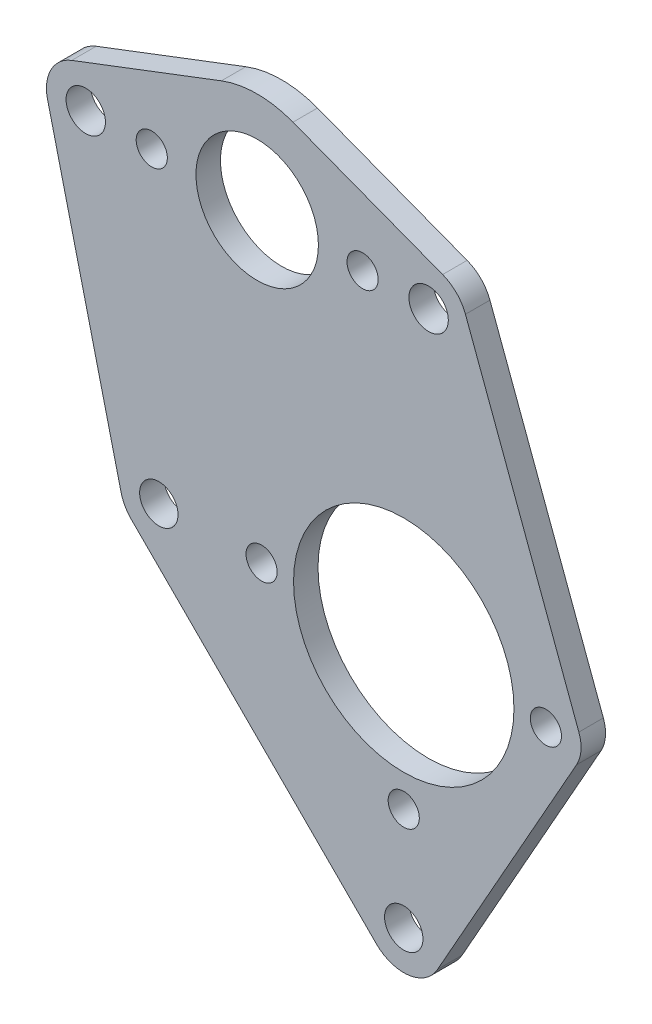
ISO-10303-21;
HEADER;
FILE_DESCRIPTION(('STEP AP214'),'2;1');
FILE_NAME('part.step','',(''),(''),'','','');
FILE_SCHEMA(('AUTOMOTIVE_DESIGN { 1 0 10303 214 1 1 1 1 }'));
ENDSEC;
DATA;
#1=APPLICATION_CONTEXT('core data for automotive mechanical design processes');
#2=APPLICATION_PROTOCOL_DEFINITION('international standard','automotive_design',2000,#1);
#3=PRODUCT_CONTEXT('',#1,'mechanical');
#4=PRODUCT('Part','Part','',(#3));
#5=PRODUCT_RELATED_PRODUCT_CATEGORY('part','',(#4));
#6=PRODUCT_DEFINITION_FORMATION('','',#4);
#7=PRODUCT_DEFINITION_CONTEXT('part definition',#1,'design');
#8=PRODUCT_DEFINITION('design','',#6,#7);
#9=PRODUCT_DEFINITION_SHAPE('','',#8);
#10=(LENGTH_UNIT() NAMED_UNIT(*) SI_UNIT(.MILLI.,.METRE.));
#11=(NAMED_UNIT(*) PLANE_ANGLE_UNIT() SI_UNIT($,.RADIAN.));
#12=(NAMED_UNIT(*) SI_UNIT($,.STERADIAN.) SOLID_ANGLE_UNIT());
#13=UNCERTAINTY_MEASURE_WITH_UNIT(LENGTH_MEASURE(1.E-05),#10,'distance_accuracy_value','');
#14=(GEOMETRIC_REPRESENTATION_CONTEXT(3) GLOBAL_UNCERTAINTY_ASSIGNED_CONTEXT((#13)) GLOBAL_UNIT_ASSIGNED_CONTEXT((#10,
#11,#12)) REPRESENTATION_CONTEXT('',''));
#15=CARTESIAN_POINT('',(0.,0.,0.));
#16=DIRECTION('',(0.,0.,1.));
#17=DIRECTION('',(1.,0.,0.));
#18=AXIS2_PLACEMENT_3D('',#15,#16,#17);
#19=CARTESIAN_POINT('',(-31.75,0.,3.175));
#20=DIRECTION('',(0.,0.,1.));
#21=DIRECTION('',(1.,0.,0.));
#22=AXIS2_PLACEMENT_3D('',#19,#20,#21);
#23=PLANE('',#22);
#24=CARTESIAN_POINT('',(-5.334,39.37,3.175));
#25=DIRECTION('',(0.,0.,1.));
#26=DIRECTION('',(1.,0.,0.));
#27=AXIS2_PLACEMENT_3D('',#24,#25,#26);
#28=CIRCLE('',#27,2.01929999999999);
#29=CARTESIAN_POINT('',(-3.31470000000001,39.37,3.175));
#30=VERTEX_POINT('',#29);
#31=EDGE_CURVE('E326',#30,#30,#28,.T.);
#32=ORIENTED_EDGE('',*,*,#31,.F.);
#33=EDGE_LOOP('',(#32));
#34=FACE_BOUND('',#33,.T.);
#35=CARTESIAN_POINT('',(-41.2242,39.37,3.175));
#36=DIRECTION('',(0.,0.,1.));
#37=DIRECTION('',(1.,0.,0.));
#38=AXIS2_PLACEMENT_3D('',#35,#36,#37);
#39=CIRCLE('',#38,2.5527);
#40=CARTESIAN_POINT('',(-38.6715,39.37,3.175));
#41=VERTEX_POINT('',#40);
#42=EDGE_CURVE('E340',#41,#41,#39,.T.);
#43=ORIENTED_EDGE('',*,*,#42,.F.);
#44=EDGE_LOOP('',(#43));
#45=FACE_BOUND('',#44,.T.);
#46=CARTESIAN_POINT('',(0.,-31.75,3.175));
#47=DIRECTION('',(0.,0.,1.));
#48=DIRECTION('',(1.,0.,0.));
#49=AXIS2_PLACEMENT_3D('',#46,#47,#48);
#50=CIRCLE('',#49,2.4892);
#51=CARTESIAN_POINT('',(2.4892,-31.75,3.175));
#52=VERTEX_POINT('',#51);
#53=EDGE_CURVE('E352',#52,#52,#50,.T.);
#54=ORIENTED_EDGE('',*,*,#53,.F.);
#55=EDGE_LOOP('',(#54));
#56=FACE_BOUND('',#55,.T.);
#57=CARTESIAN_POINT('',(0.,-18.4277,3.175));
#58=DIRECTION('',(0.,0.,1.));
#59=DIRECTION('',(1.,0.,0.));
#60=AXIS2_PLACEMENT_3D('',#57,#58,#59);
#61=CIRCLE('',#60,2.0193);
#62=CARTESIAN_POINT('',(2.0193,-18.4277,3.175));
#63=VERTEX_POINT('',#62);
#64=EDGE_CURVE('E364',#63,#63,#61,.T.);
#65=ORIENTED_EDGE('',*,*,#64,.F.);
#66=EDGE_LOOP('',(#65));
#67=FACE_BOUND('',#66,.T.);
#68=CARTESIAN_POINT('',(18.4277,0.,3.175));
#69=DIRECTION('',(0.,0.,1.));
#70=DIRECTION('',(1.,0.,0.));
#71=AXIS2_PLACEMENT_3D('',#68,#69,#70);
#72=CIRCLE('',#71,2.0193);
#73=CARTESIAN_POINT('',(20.447,0.,3.175));
#74=VERTEX_POINT('',#73);
#75=EDGE_CURVE('E376',#74,#74,#72,.T.);
#76=ORIENTED_EDGE('',*,*,#75,.F.);
#77=EDGE_LOOP('',(#76));
#78=FACE_BOUND('',#77,.T.);
#79=CARTESIAN_POINT('',(-31.75,0.,3.175));
#80=DIRECTION('',(0.,0.,1.));
#81=DIRECTION('',(1.,0.,0.));
#82=AXIS2_PLACEMENT_3D('',#79,#80,#81);
#83=CIRCLE('',#82,5.0292);
#84=CARTESIAN_POINT('',(-36.6377622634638,-1.18432795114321,3.175));
#85=VERTEX_POINT('',#84);
#86=CARTESIAN_POINT('',(-35.3061814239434,-3.55618142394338,3.175));
#87=VERTEX_POINT('',#86);
#88=EDGE_CURVE('E182',#85,#87,#83,.T.);
#89=ORIENTED_EDGE('',*,*,#88,.T.);
#90=DIRECTION('',(0.707106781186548,-0.707106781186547,0.));
#91=VECTOR('',#90,1.);
#92=CARTESIAN_POINT('',(-3.55618142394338,-35.3061814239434,3.175));
#93=LINE('',#92,#91);
#94=CARTESIAN_POINT('',(-3.55618142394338,-35.3061814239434,3.175));
#95=VERTEX_POINT('',#94);
#96=EDGE_CURVE('E108',#87,#95,#93,.T.);
#97=ORIENTED_EDGE('',*,*,#96,.T.);
#98=CARTESIAN_POINT('',(0.,-31.75,3.175));
#99=DIRECTION('',(0.,0.,1.));
#100=DIRECTION('',(1.,0.,0.));
#101=AXIS2_PLACEMENT_3D('',#98,#99,#100);
#102=CIRCLE('',#101,5.02919999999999);
#103=CARTESIAN_POINT('',(4.38161795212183,-34.2186588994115,3.175));
#104=VERTEX_POINT('',#103);
#105=EDGE_CURVE('E209',#95,#104,#102,.T.);
#106=ORIENTED_EDGE('',*,*,#105,.T.);
#107=DIRECTION('',(0.490865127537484,0.871235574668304,0.));
#108=VECTOR('',#107,1.);
#109=CARTESIAN_POINT('',(4.38161795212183,-34.2186588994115,3.175));
#110=LINE('',#109,#108);
#111=CARTESIAN_POINT('',(22.3999243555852,-2.23800137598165,3.175));
#112=VERTEX_POINT('',#111);
#113=EDGE_CURVE('E227',#104,#112,#110,.T.);
#114=ORIENTED_EDGE('',*,*,#113,.T.);
#115=CARTESIAN_POINT('',(18.4277,0.,3.175));
#116=DIRECTION('',(0.,0.,1.));
#117=DIRECTION('',(-1.,0.,0.));
#118=AXIS2_PLACEMENT_3D('',#115,#116,#117);
#119=CIRCLE('',#118,4.55929999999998);
#120=CARTESIAN_POINT('',(22.7013590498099,1.58841267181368,3.175));
#121=VERTEX_POINT('',#120);
#122=EDGE_CURVE('E224',#112,#121,#119,.T.);
#123=ORIENTED_EDGE('',*,*,#122,.T.);
#124=DIRECTION('',(-0.348389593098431,0.937349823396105,0.));
#125=VECTOR('',#124,1.);
#126=CARTESIAN_POINT('',(7.99944144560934,41.1442436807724,3.175));
#127=LINE('',#126,#125);
#128=CARTESIAN_POINT('',(7.99944144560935,41.1442436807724,3.175));
#129=VERTEX_POINT('',#128);
#130=EDGE_CURVE('E226',#121,#129,#127,.T.);
#131=ORIENTED_EDGE('',*,*,#130,.T.);
#132=CARTESIAN_POINT('',(3.2258,39.37,3.175));
#133=DIRECTION('',(0.,0.,1.));
#134=DIRECTION('',(1.,0.,0.));
#135=AXIS2_PLACEMENT_3D('',#132,#133,#134);
#136=CIRCLE('',#135,5.0927);
#137=CARTESIAN_POINT('',(5.04171131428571,44.12794697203,3.175));
#138=VERTEX_POINT('',#137);
#139=EDGE_CURVE('E229',#129,#138,#136,.T.);
#140=ORIENTED_EDGE('',*,*,#139,.T.);
#141=DIRECTION('',(-0.934268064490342,0.356571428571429,0.));
#142=VECTOR('',#141,1.);
#143=CARTESIAN_POINT('',(-14.3575314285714,51.531834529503,3.175));
#144=LINE('',#143,#142);
#145=CARTESIAN_POINT('',(-14.3575314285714,51.531834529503,3.175));
#146=VERTEX_POINT('',#145);
#147=EDGE_CURVE('E235',#138,#146,#144,.T.);
#148=ORIENTED_EDGE('',*,*,#147,.T.);
#149=CARTESIAN_POINT('',(-18.9992,39.37,3.175));
#150=DIRECTION('',(0.,0.,1.));
#151=DIRECTION('',(1.,0.,0.));
#152=AXIS2_PLACEMENT_3D('',#149,#150,#151);
#153=CIRCLE('',#152,13.0175);
#154=CARTESIAN_POINT('',(-23.6408685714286,51.531834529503,3.175));
#155=VERTEX_POINT('',#154);
#156=EDGE_CURVE('E139',#146,#155,#153,.T.);
#157=ORIENTED_EDGE('',*,*,#156,.T.);
#158=DIRECTION('',(-0.934268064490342,-0.356571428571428,0.));
#159=VECTOR('',#158,1.);
#160=CARTESIAN_POINT('',(-43.0401113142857,44.12794697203,3.175));
#161=LINE('',#160,#159);
#162=CARTESIAN_POINT('',(-43.0401113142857,44.12794697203,3.175));
#163=VERTEX_POINT('',#162);
#164=EDGE_CURVE('E133',#155,#163,#161,.T.);
#165=ORIENTED_EDGE('',*,*,#164,.T.);
#166=CARTESIAN_POINT('',(-41.2242,39.37,3.175));
#167=DIRECTION('',(0.,0.,1.));
#168=DIRECTION('',(1.,0.,0.));
#169=AXIS2_PLACEMENT_3D('',#166,#167,#168);
#170=CIRCLE('',#169,5.09269999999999);
#171=CARTESIAN_POINT('',(-46.173676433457,38.17071841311,3.175));
#172=VERTEX_POINT('',#171);
#173=EDGE_CURVE('E137',#163,#172,#170,.T.);
#174=ORIENTED_EDGE('',*,*,#173,.T.);
#175=DIRECTION('',(0.235490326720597,-0.971876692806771,0.));
#176=VECTOR('',#175,1.);
#177=CARTESIAN_POINT('',(-36.6377622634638,-1.18432795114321,3.175));
#178=LINE('',#177,#176);
#179=EDGE_CURVE('E53',#172,#85,#178,.T.);
#180=ORIENTED_EDGE('',*,*,#179,.T.);
#181=EDGE_LOOP('',(#89,#97,#106,#114,#123,#131,#140,#148,#157,#165,#174,#180));
#182=FACE_BOUND('',#181,.T.);
#183=CARTESIAN_POINT('',(0.,0.,3.175));
#184=DIRECTION('',(0.,0.,1.));
#185=DIRECTION('',(1.,0.,0.));
#186=AXIS2_PLACEMENT_3D('',#183,#184,#185);
#187=CIRCLE('',#186,14.2875);
#188=CARTESIAN_POINT('',(14.2875,0.,3.175));
#189=VERTEX_POINT('',#188);
#190=EDGE_CURVE('E161',#189,#189,#187,.T.);
#191=ORIENTED_EDGE('',*,*,#190,.F.);
#192=EDGE_LOOP('',(#191));
#193=FACE_BOUND('',#192,.T.);
#194=CARTESIAN_POINT('',(-18.4277,0.,3.175));
#195=DIRECTION('',(0.,0.,1.));
#196=DIRECTION('',(1.,0.,0.));
#197=AXIS2_PLACEMENT_3D('',#194,#195,#196);
#198=CIRCLE('',#197,2.0193);
#199=CARTESIAN_POINT('',(-16.4084,0.,3.175));
#200=VERTEX_POINT('',#199);
#201=EDGE_CURVE('E370',#200,#200,#198,.T.);
#202=ORIENTED_EDGE('',*,*,#201,.F.);
#203=EDGE_LOOP('',(#202));
#204=FACE_BOUND('',#203,.T.);
#205=CARTESIAN_POINT('',(-31.75,0.,3.175));
#206=DIRECTION('',(0.,0.,1.));
#207=DIRECTION('',(1.,0.,0.));
#208=AXIS2_PLACEMENT_3D('',#205,#206,#207);
#209=CIRCLE('',#208,2.4892);
#210=CARTESIAN_POINT('',(-29.2608,0.,3.175));
#211=VERTEX_POINT('',#210);
#212=EDGE_CURVE('E358',#211,#211,#209,.T.);
#213=ORIENTED_EDGE('',*,*,#212,.F.);
#214=EDGE_LOOP('',(#213));
#215=FACE_BOUND('',#214,.T.);
#216=CARTESIAN_POINT('',(-18.9992,39.37,3.175));
#217=DIRECTION('',(0.,0.,1.));
#218=DIRECTION('',(1.,0.,0.));
#219=AXIS2_PLACEMENT_3D('',#216,#217,#218);
#220=CIRCLE('',#219,7.93750000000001);
#221=CARTESIAN_POINT('',(-11.0617,39.37,3.175));
#222=VERTEX_POINT('',#221);
#223=EDGE_CURVE('E346',#222,#222,#220,.T.);
#224=ORIENTED_EDGE('',*,*,#223,.F.);
#225=EDGE_LOOP('',(#224));
#226=FACE_BOUND('',#225,.T.);
#227=CARTESIAN_POINT('',(3.2258,39.37,3.175));
#228=DIRECTION('',(0.,0.,1.));
#229=DIRECTION('',(1.,0.,0.));
#230=AXIS2_PLACEMENT_3D('',#227,#228,#229);
#231=CIRCLE('',#230,2.5527);
#232=CARTESIAN_POINT('',(5.7785,39.37,3.175));
#233=VERTEX_POINT('',#232);
#234=EDGE_CURVE('E333',#233,#233,#231,.T.);
#235=ORIENTED_EDGE('',*,*,#234,.F.);
#236=EDGE_LOOP('',(#235));
#237=FACE_BOUND('',#236,.T.);
#238=CARTESIAN_POINT('',(-32.6644,39.37,3.175));
#239=DIRECTION('',(0.,0.,1.));
#240=DIRECTION('',(1.,0.,0.));
#241=AXIS2_PLACEMENT_3D('',#238,#239,#240);
#242=CIRCLE('',#241,2.0193);
#243=CARTESIAN_POINT('',(-30.6451,39.37,3.175));
#244=VERTEX_POINT('',#243);
#245=EDGE_CURVE('E317',#244,#244,#242,.T.);
#246=ORIENTED_EDGE('',*,*,#245,.F.);
#247=EDGE_LOOP('',(#246));
#248=FACE_BOUND('',#247,.T.);
#249=ADVANCED_FACE('F36',(#34,#45,#56,#67,#78,#182,#193,#204,#215,#226,#237,#248),#23,.T.);
#250=CARTESIAN_POINT('',(-31.75,0.,0.));
#251=DIRECTION('',(0.,0.,1.));
#252=DIRECTION('',(1.,0.,0.));
#253=AXIS2_PLACEMENT_3D('',#250,#251,#252);
#254=PLANE('',#253);
#255=CARTESIAN_POINT('',(-31.75,0.,0.));
#256=DIRECTION('',(0.,0.,1.));
#257=DIRECTION('',(1.,0.,0.));
#258=AXIS2_PLACEMENT_3D('',#255,#256,#257);
#259=CIRCLE('',#258,5.0292);
#260=CARTESIAN_POINT('',(-36.6377622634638,-1.18432795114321,0.));
#261=VERTEX_POINT('',#260);
#262=CARTESIAN_POINT('',(-35.3061814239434,-3.55618142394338,0.));
#263=VERTEX_POINT('',#262);
#264=EDGE_CURVE('E157',#261,#263,#259,.T.);
#265=ORIENTED_EDGE('',*,*,#264,.F.);
#266=DIRECTION('',(0.235490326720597,-0.971876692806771,0.));
#267=VECTOR('',#266,1.);
#268=CARTESIAN_POINT('',(-36.6377622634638,-1.18432795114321,0.));
#269=LINE('',#268,#267);
#270=CARTESIAN_POINT('',(-46.173676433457,38.17071841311,0.));
#271=VERTEX_POINT('',#270);
#272=EDGE_CURVE('E100',#271,#261,#269,.T.);
#273=ORIENTED_EDGE('',*,*,#272,.F.);
#274=CARTESIAN_POINT('',(-41.2242,39.37,0.));
#275=DIRECTION('',(0.,0.,1.));
#276=DIRECTION('',(1.,0.,0.));
#277=AXIS2_PLACEMENT_3D('',#274,#275,#276);
#278=CIRCLE('',#277,5.09269999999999);
#279=CARTESIAN_POINT('',(-43.0401113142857,44.12794697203,0.));
#280=VERTEX_POINT('',#279);
#281=EDGE_CURVE('E94',#280,#271,#278,.T.);
#282=ORIENTED_EDGE('',*,*,#281,.F.);
#283=DIRECTION('',(-0.934268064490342,-0.356571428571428,0.));
#284=VECTOR('',#283,1.);
#285=CARTESIAN_POINT('',(-43.0401113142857,44.12794697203,0.));
#286=LINE('',#285,#284);
#287=CARTESIAN_POINT('',(-23.6408685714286,51.531834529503,0.));
#288=VERTEX_POINT('',#287);
#289=EDGE_CURVE('E147',#288,#280,#286,.T.);
#290=ORIENTED_EDGE('',*,*,#289,.F.);
#291=CARTESIAN_POINT('',(-18.9992,39.37,0.));
#292=DIRECTION('',(0.,0.,1.));
#293=DIRECTION('',(1.,0.,0.));
#294=AXIS2_PLACEMENT_3D('',#291,#292,#293);
#295=CIRCLE('',#294,13.0175);
#296=CARTESIAN_POINT('',(-14.3575314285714,51.531834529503,0.));
#297=VERTEX_POINT('',#296);
#298=EDGE_CURVE('E177',#297,#288,#295,.T.);
#299=ORIENTED_EDGE('',*,*,#298,.F.);
#300=DIRECTION('',(-0.934268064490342,0.356571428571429,0.));
#301=VECTOR('',#300,1.);
#302=CARTESIAN_POINT('',(-14.3575314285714,51.531834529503,0.));
#303=LINE('',#302,#301);
#304=CARTESIAN_POINT('',(5.04171131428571,44.12794697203,0.));
#305=VERTEX_POINT('',#304);
#306=EDGE_CURVE('E174',#305,#297,#303,.T.);
#307=ORIENTED_EDGE('',*,*,#306,.F.);
#308=CARTESIAN_POINT('',(3.2258,39.37,0.));
#309=DIRECTION('',(0.,0.,1.));
#310=DIRECTION('',(1.,0.,0.));
#311=AXIS2_PLACEMENT_3D('',#308,#309,#310);
#312=CIRCLE('',#311,5.0927);
#313=CARTESIAN_POINT('',(7.99944144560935,41.1442436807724,0.));
#314=VERTEX_POINT('',#313);
#315=EDGE_CURVE('E172',#314,#305,#312,.T.);
#316=ORIENTED_EDGE('',*,*,#315,.F.);
#317=DIRECTION('',(-0.348389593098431,0.937349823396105,0.));
#318=VECTOR('',#317,1.);
#319=CARTESIAN_POINT('',(7.99944144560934,41.1442436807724,0.));
#320=LINE('',#319,#318);
#321=CARTESIAN_POINT('',(22.7013590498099,1.58841267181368,0.));
#322=VERTEX_POINT('',#321);
#323=EDGE_CURVE('E170',#322,#314,#320,.T.);
#324=ORIENTED_EDGE('',*,*,#323,.F.);
#325=CARTESIAN_POINT('',(18.4277,0.,0.));
#326=DIRECTION('',(0.,0.,1.));
#327=DIRECTION('',(-1.,0.,0.));
#328=AXIS2_PLACEMENT_3D('',#325,#326,#327);
#329=CIRCLE('',#328,4.5593);
#330=CARTESIAN_POINT('',(22.3999243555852,-2.23800137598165,0.));
#331=VERTEX_POINT('',#330);
#332=EDGE_CURVE('E168',#331,#322,#329,.T.);
#333=ORIENTED_EDGE('',*,*,#332,.F.);
#334=DIRECTION('',(0.490865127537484,0.871235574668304,0.));
#335=VECTOR('',#334,1.);
#336=CARTESIAN_POINT('',(4.38161795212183,-34.2186588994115,0.));
#337=LINE('',#336,#335);
#338=CARTESIAN_POINT('',(4.38161795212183,-34.2186588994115,0.));
#339=VERTEX_POINT('',#338);
#340=EDGE_CURVE('E165',#339,#331,#337,.T.);
#341=ORIENTED_EDGE('',*,*,#340,.F.);
#342=CARTESIAN_POINT('',(0.,-31.75,0.));
#343=DIRECTION('',(0.,0.,1.));
#344=DIRECTION('',(1.,0.,0.));
#345=AXIS2_PLACEMENT_3D('',#342,#343,#344);
#346=CIRCLE('',#345,5.02919999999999);
#347=CARTESIAN_POINT('',(-3.55618142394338,-35.3061814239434,0.));
#348=VERTEX_POINT('',#347);
#349=EDGE_CURVE('E163',#348,#339,#346,.T.);
#350=ORIENTED_EDGE('',*,*,#349,.F.);
#351=DIRECTION('',(0.707106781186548,-0.707106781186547,0.));
#352=VECTOR('',#351,1.);
#353=CARTESIAN_POINT('',(-3.55618142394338,-35.3061814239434,0.));
#354=LINE('',#353,#352);
#355=EDGE_CURVE('E160',#263,#348,#354,.T.);
#356=ORIENTED_EDGE('',*,*,#355,.F.);
#357=EDGE_LOOP('',(#265,#273,#282,#290,#299,#307,#316,#324,#333,#341,#350,#356));
#358=FACE_BOUND('',#357,.T.);
#359=CARTESIAN_POINT('',(0.,0.,0.));
#360=DIRECTION('',(0.,0.,1.));
#361=DIRECTION('',(1.,0.,0.));
#362=AXIS2_PLACEMENT_3D('',#359,#360,#361);
#363=CIRCLE('',#362,14.2875);
#364=CARTESIAN_POINT('',(14.2875,0.,0.));
#365=VERTEX_POINT('',#364);
#366=EDGE_CURVE('E379',#365,#365,#363,.T.);
#367=ORIENTED_EDGE('',*,*,#366,.T.);
#368=EDGE_LOOP('',(#367));
#369=FACE_BOUND('',#368,.T.);
#370=CARTESIAN_POINT('',(18.4277,0.,0.));
#371=DIRECTION('',(0.,0.,1.));
#372=DIRECTION('',(1.,0.,0.));
#373=AXIS2_PLACEMENT_3D('',#370,#371,#372);
#374=CIRCLE('',#373,2.0193);
#375=CARTESIAN_POINT('',(20.447,0.,0.));
#376=VERTEX_POINT('',#375);
#377=EDGE_CURVE('E373',#376,#376,#374,.T.);
#378=ORIENTED_EDGE('',*,*,#377,.T.);
#379=EDGE_LOOP('',(#378));
#380=FACE_BOUND('',#379,.T.);
#381=CARTESIAN_POINT('',(-18.4277,0.,0.));
#382=DIRECTION('',(0.,0.,1.));
#383=DIRECTION('',(1.,0.,0.));
#384=AXIS2_PLACEMENT_3D('',#381,#382,#383);
#385=CIRCLE('',#384,2.0193);
#386=CARTESIAN_POINT('',(-16.4084,0.,0.));
#387=VERTEX_POINT('',#386);
#388=EDGE_CURVE('E367',#387,#387,#385,.T.);
#389=ORIENTED_EDGE('',*,*,#388,.T.);
#390=EDGE_LOOP('',(#389));
#391=FACE_BOUND('',#390,.T.);
#392=CARTESIAN_POINT('',(0.,-18.4277,0.));
#393=DIRECTION('',(0.,0.,1.));
#394=DIRECTION('',(1.,0.,0.));
#395=AXIS2_PLACEMENT_3D('',#392,#393,#394);
#396=CIRCLE('',#395,2.0193);
#397=CARTESIAN_POINT('',(2.0193,-18.4277,0.));
#398=VERTEX_POINT('',#397);
#399=EDGE_CURVE('E361',#398,#398,#396,.T.);
#400=ORIENTED_EDGE('',*,*,#399,.T.);
#401=EDGE_LOOP('',(#400));
#402=FACE_BOUND('',#401,.T.);
#403=CARTESIAN_POINT('',(-31.75,0.,0.));
#404=DIRECTION('',(0.,0.,1.));
#405=DIRECTION('',(1.,0.,0.));
#406=AXIS2_PLACEMENT_3D('',#403,#404,#405);
#407=CIRCLE('',#406,2.4892);
#408=CARTESIAN_POINT('',(-29.2608,0.,0.));
#409=VERTEX_POINT('',#408);
#410=EDGE_CURVE('E355',#409,#409,#407,.T.);
#411=ORIENTED_EDGE('',*,*,#410,.T.);
#412=EDGE_LOOP('',(#411));
#413=FACE_BOUND('',#412,.T.);
#414=CARTESIAN_POINT('',(0.,-31.75,0.));
#415=DIRECTION('',(0.,0.,1.));
#416=DIRECTION('',(1.,0.,0.));
#417=AXIS2_PLACEMENT_3D('',#414,#415,#416);
#418=CIRCLE('',#417,2.4892);
#419=CARTESIAN_POINT('',(2.4892,-31.75,0.));
#420=VERTEX_POINT('',#419);
#421=EDGE_CURVE('E349',#420,#420,#418,.T.);
#422=ORIENTED_EDGE('',*,*,#421,.T.);
#423=EDGE_LOOP('',(#422));
#424=FACE_BOUND('',#423,.T.);
#425=CARTESIAN_POINT('',(-18.9992,39.37,0.));
#426=DIRECTION('',(0.,0.,1.));
#427=DIRECTION('',(1.,0.,0.));
#428=AXIS2_PLACEMENT_3D('',#425,#426,#427);
#429=CIRCLE('',#428,7.93750000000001);
#430=CARTESIAN_POINT('',(-11.0617,39.37,0.));
#431=VERTEX_POINT('',#430);
#432=EDGE_CURVE('E343',#431,#431,#429,.T.);
#433=ORIENTED_EDGE('',*,*,#432,.T.);
#434=EDGE_LOOP('',(#433));
#435=FACE_BOUND('',#434,.T.);
#436=CARTESIAN_POINT('',(-41.2242,39.37,0.));
#437=DIRECTION('',(0.,0.,1.));
#438=DIRECTION('',(1.,0.,0.));
#439=AXIS2_PLACEMENT_3D('',#436,#437,#438);
#440=CIRCLE('',#439,2.5527);
#441=CARTESIAN_POINT('',(-38.6715,39.37,0.));
#442=VERTEX_POINT('',#441);
#443=EDGE_CURVE('E337',#442,#442,#440,.T.);
#444=ORIENTED_EDGE('',*,*,#443,.T.);
#445=EDGE_LOOP('',(#444));
#446=FACE_BOUND('',#445,.T.);
#447=CARTESIAN_POINT('',(3.2258,39.37,0.));
#448=DIRECTION('',(0.,0.,1.));
#449=DIRECTION('',(1.,0.,0.));
#450=AXIS2_PLACEMENT_3D('',#447,#448,#449);
#451=CIRCLE('',#450,2.5527);
#452=CARTESIAN_POINT('',(5.7785,39.37,0.));
#453=VERTEX_POINT('',#452);
#454=EDGE_CURVE('E329',#453,#453,#451,.T.);
#455=ORIENTED_EDGE('',*,*,#454,.T.);
#456=EDGE_LOOP('',(#455));
#457=FACE_BOUND('',#456,.T.);
#458=CARTESIAN_POINT('',(-5.334,39.37,0.));
#459=DIRECTION('',(0.,0.,1.));
#460=DIRECTION('',(1.,0.,0.));
#461=AXIS2_PLACEMENT_3D('',#458,#459,#460);
#462=CIRCLE('',#461,2.01929999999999);
#463=CARTESIAN_POINT('',(-3.31470000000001,39.37,0.));
#464=VERTEX_POINT('',#463);
#465=EDGE_CURVE('E323',#464,#464,#462,.T.);
#466=ORIENTED_EDGE('',*,*,#465,.T.);
#467=EDGE_LOOP('',(#466));
#468=FACE_BOUND('',#467,.T.);
#469=CARTESIAN_POINT('',(-32.6644,39.37,0.));
#470=DIRECTION('',(0.,0.,1.));
#471=DIRECTION('',(1.,0.,0.));
#472=AXIS2_PLACEMENT_3D('',#469,#470,#471);
#473=CIRCLE('',#472,2.0193);
#474=CARTESIAN_POINT('',(-30.6451,39.37,0.));
#475=VERTEX_POINT('',#474);
#476=EDGE_CURVE('E320',#475,#475,#473,.T.);
#477=ORIENTED_EDGE('',*,*,#476,.T.);
#478=EDGE_LOOP('',(#477));
#479=FACE_BOUND('',#478,.T.);
#480=ADVANCED_FACE('F213',(#358,#369,#380,#391,#402,#413,#424,#435,#446,#457,#468,#479),#254,.F.);
#481=CARTESIAN_POINT('',(-31.75,0.,3.175));
#482=DIRECTION('',(0.,0.,-1.));
#483=DIRECTION('',(-1.,0.,0.));
#484=AXIS2_PLACEMENT_3D('',#481,#482,#483);
#485=CYLINDRICAL_SURFACE('',#484,5.0292);
#486=ORIENTED_EDGE('',*,*,#264,.T.);
#487=DIRECTION('',(0.,0.,-1.));
#488=VECTOR('',#487,1.);
#489=CARTESIAN_POINT('',(-35.3061814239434,-3.55618142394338,3.175));
#490=LINE('',#489,#488);
#491=EDGE_CURVE('E11',#87,#263,#490,.T.);
#492=ORIENTED_EDGE('',*,*,#491,.F.);
#493=ORIENTED_EDGE('',*,*,#88,.F.);
#494=DIRECTION('',(0.,0.,-1.));
#495=VECTOR('',#494,1.);
#496=CARTESIAN_POINT('',(-36.6377622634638,-1.18432795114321,3.175));
#497=LINE('',#496,#495);
#498=EDGE_CURVE('E153',#85,#261,#497,.T.);
#499=ORIENTED_EDGE('',*,*,#498,.T.);
#500=EDGE_LOOP('',(#486,#492,#493,#499));
#501=FACE_BOUND('',#500,.T.);
#502=ADVANCED_FACE('F38',(#501),#485,.T.);
#503=CARTESIAN_POINT('',(-3.55618142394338,-35.3061814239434,3.175));
#504=DIRECTION('',(0.707106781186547,0.707106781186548,0.));
#505=DIRECTION('',(-0.707106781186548,0.707106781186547,0.));
#506=AXIS2_PLACEMENT_3D('',#503,#504,#505);
#507=PLANE('',#506);
#508=ORIENTED_EDGE('',*,*,#355,.T.);
#509=DIRECTION('',(0.,0.,-1.));
#510=VECTOR('',#509,1.);
#511=CARTESIAN_POINT('',(-3.55618142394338,-35.3061814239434,3.175));
#512=LINE('',#511,#510);
#513=EDGE_CURVE('E45',#95,#348,#512,.T.);
#514=ORIENTED_EDGE('',*,*,#513,.F.);
#515=ORIENTED_EDGE('',*,*,#96,.F.);
#516=ORIENTED_EDGE('',*,*,#491,.T.);
#517=EDGE_LOOP('',(#508,#514,#515,#516));
#518=FACE_BOUND('',#517,.T.);
#519=ADVANCED_FACE('F553',(#518),#507,.F.);
#520=CARTESIAN_POINT('',(0.,-31.75,3.175));
#521=DIRECTION('',(0.,0.,-1.));
#522=DIRECTION('',(-1.,0.,0.));
#523=AXIS2_PLACEMENT_3D('',#520,#521,#522);
#524=CYLINDRICAL_SURFACE('',#523,5.02919999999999);
#525=ORIENTED_EDGE('',*,*,#349,.T.);
#526=DIRECTION('',(0.,0.,-1.));
#527=VECTOR('',#526,1.);
#528=CARTESIAN_POINT('',(4.38161795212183,-34.2186588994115,3.175));
#529=LINE('',#528,#527);
#530=EDGE_CURVE('E201',#104,#339,#529,.T.);
#531=ORIENTED_EDGE('',*,*,#530,.F.);
#532=ORIENTED_EDGE('',*,*,#105,.F.);
#533=ORIENTED_EDGE('',*,*,#513,.T.);
#534=EDGE_LOOP('',(#525,#531,#532,#533));
#535=FACE_BOUND('',#534,.T.);
#536=ADVANCED_FACE('F207',(#535),#524,.T.);
#537=CARTESIAN_POINT('',(4.38161795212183,-34.2186588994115,3.175));
#538=DIRECTION('',(-0.871235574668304,0.490865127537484,0.));
#539=DIRECTION('',(-0.490865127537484,-0.871235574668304,0.));
#540=AXIS2_PLACEMENT_3D('',#537,#538,#539);
#541=PLANE('',#540);
#542=ORIENTED_EDGE('',*,*,#340,.T.);
#543=DIRECTION('',(0.,0.,-1.));
#544=VECTOR('',#543,1.);
#545=CARTESIAN_POINT('',(22.3999243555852,-2.23800137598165,3.175));
#546=LINE('',#545,#544);
#547=EDGE_CURVE('E198',#112,#331,#546,.T.);
#548=ORIENTED_EDGE('',*,*,#547,.F.);
#549=ORIENTED_EDGE('',*,*,#113,.F.);
#550=ORIENTED_EDGE('',*,*,#530,.T.);
#551=EDGE_LOOP('',(#542,#548,#549,#550));
#552=FACE_BOUND('',#551,.T.);
#553=ADVANCED_FACE('F218',(#552),#541,.F.);
#554=CARTESIAN_POINT('',(18.4277,0.,3.175));
#555=DIRECTION('',(0.,0.,-1.));
#556=DIRECTION('',(-1.,0.,0.));
#557=AXIS2_PLACEMENT_3D('',#554,#555,#556);
#558=CYLINDRICAL_SURFACE('',#557,4.5593);
#559=ORIENTED_EDGE('',*,*,#332,.T.);
#560=DIRECTION('',(0.,0.,-1.));
#561=VECTOR('',#560,1.);
#562=CARTESIAN_POINT('',(22.7013590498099,1.58841267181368,3.175));
#563=LINE('',#562,#561);
#564=EDGE_CURVE('E195',#121,#322,#563,.T.);
#565=ORIENTED_EDGE('',*,*,#564,.F.);
#566=ORIENTED_EDGE('',*,*,#122,.F.);
#567=ORIENTED_EDGE('',*,*,#547,.T.);
#568=EDGE_LOOP('',(#559,#565,#566,#567));
#569=FACE_BOUND('',#568,.T.);
#570=ADVANCED_FACE('F222',(#569),#558,.T.);
#571=CARTESIAN_POINT('',(7.99944144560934,41.1442436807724,3.175));
#572=DIRECTION('',(-0.937349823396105,-0.348389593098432,0.));
#573=DIRECTION('',(0.348389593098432,-0.937349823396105,0.));
#574=AXIS2_PLACEMENT_3D('',#571,#572,#573);
#575=PLANE('',#574);
#576=ORIENTED_EDGE('',*,*,#323,.T.);
#577=DIRECTION('',(0.,0.,-1.));
#578=VECTOR('',#577,1.);
#579=CARTESIAN_POINT('',(7.99944144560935,41.1442436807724,3.175));
#580=LINE('',#579,#578);
#581=EDGE_CURVE('E192',#129,#314,#580,.T.);
#582=ORIENTED_EDGE('',*,*,#581,.F.);
#583=ORIENTED_EDGE('',*,*,#130,.F.);
#584=ORIENTED_EDGE('',*,*,#564,.T.);
#585=EDGE_LOOP('',(#576,#582,#583,#584));
#586=FACE_BOUND('',#585,.T.);
#587=ADVANCED_FACE('F517',(#586),#575,.F.);
#588=CARTESIAN_POINT('',(3.2258,39.37,3.175));
#589=DIRECTION('',(0.,0.,-1.));
#590=DIRECTION('',(-1.,0.,0.));
#591=AXIS2_PLACEMENT_3D('',#588,#589,#590);
#592=CYLINDRICAL_SURFACE('',#591,5.0927);
#593=ORIENTED_EDGE('',*,*,#315,.T.);
#594=DIRECTION('',(0.,0.,-1.));
#595=VECTOR('',#594,1.);
#596=CARTESIAN_POINT('',(5.04171131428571,44.12794697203,3.175));
#597=LINE('',#596,#595);
#598=EDGE_CURVE('E189',#138,#305,#597,.T.);
#599=ORIENTED_EDGE('',*,*,#598,.F.);
#600=ORIENTED_EDGE('',*,*,#139,.F.);
#601=ORIENTED_EDGE('',*,*,#581,.T.);
#602=EDGE_LOOP('',(#593,#599,#600,#601));
#603=FACE_BOUND('',#602,.T.);
#604=ADVANCED_FACE('F508',(#603),#592,.T.);
#605=CARTESIAN_POINT('',(-14.3575314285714,51.531834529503,3.175));
#606=DIRECTION('',(-0.356571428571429,-0.934268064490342,0.));
#607=DIRECTION('',(0.934268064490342,-0.356571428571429,0.));
#608=AXIS2_PLACEMENT_3D('',#605,#606,#607);
#609=PLANE('',#608);
#610=ORIENTED_EDGE('',*,*,#306,.T.);
#611=DIRECTION('',(0.,0.,-1.));
#612=VECTOR('',#611,1.);
#613=CARTESIAN_POINT('',(-14.3575314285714,51.531834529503,3.175));
#614=LINE('',#613,#612);
#615=EDGE_CURVE('E186',#146,#297,#614,.T.);
#616=ORIENTED_EDGE('',*,*,#615,.F.);
#617=ORIENTED_EDGE('',*,*,#147,.F.);
#618=ORIENTED_EDGE('',*,*,#598,.T.);
#619=EDGE_LOOP('',(#610,#616,#617,#618));
#620=FACE_BOUND('',#619,.T.);
#621=ADVANCED_FACE('F244',(#620),#609,.F.);
#622=CARTESIAN_POINT('',(-18.9992,39.37,3.175));
#623=DIRECTION('',(0.,0.,-1.));
#624=DIRECTION('',(-1.,0.,0.));
#625=AXIS2_PLACEMENT_3D('',#622,#623,#624);
#626=CYLINDRICAL_SURFACE('',#625,13.0175);
#627=ORIENTED_EDGE('',*,*,#298,.T.);
#628=DIRECTION('',(0.,0.,-1.));
#629=VECTOR('',#628,1.);
#630=CARTESIAN_POINT('',(-23.6408685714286,51.531834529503,3.175));
#631=LINE('',#630,#629);
#632=EDGE_CURVE('E148',#155,#288,#631,.T.);
#633=ORIENTED_EDGE('',*,*,#632,.F.);
#634=ORIENTED_EDGE('',*,*,#156,.F.);
#635=ORIENTED_EDGE('',*,*,#615,.T.);
#636=EDGE_LOOP('',(#627,#633,#634,#635));
#637=FACE_BOUND('',#636,.T.);
#638=ADVANCED_FACE('F248',(#637),#626,.T.);
#639=CARTESIAN_POINT('',(-43.0401113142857,44.12794697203,3.175));
#640=DIRECTION('',(0.356571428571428,-0.934268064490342,0.));
#641=DIRECTION('',(0.934268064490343,0.356571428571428,0.));
#642=AXIS2_PLACEMENT_3D('',#639,#640,#641);
#643=PLANE('',#642);
#644=ORIENTED_EDGE('',*,*,#289,.T.);
#645=DIRECTION('',(0.,0.,-1.));
#646=VECTOR('',#645,1.);
#647=CARTESIAN_POINT('',(-43.0401113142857,44.12794697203,3.175));
#648=LINE('',#647,#646);
#649=EDGE_CURVE('E144',#163,#280,#648,.T.);
#650=ORIENTED_EDGE('',*,*,#649,.F.);
#651=ORIENTED_EDGE('',*,*,#164,.F.);
#652=ORIENTED_EDGE('',*,*,#632,.T.);
#653=EDGE_LOOP('',(#644,#650,#651,#652));
#654=FACE_BOUND('',#653,.T.);
#655=ADVANCED_FACE('F145',(#654),#643,.F.);
#656=CARTESIAN_POINT('',(-41.2242,39.37,3.175));
#657=DIRECTION('',(0.,0.,-1.));
#658=DIRECTION('',(-1.,0.,0.));
#659=AXIS2_PLACEMENT_3D('',#656,#657,#658);
#660=CYLINDRICAL_SURFACE('',#659,5.09269999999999);
#661=ORIENTED_EDGE('',*,*,#281,.T.);
#662=DIRECTION('',(0.,0.,-1.));
#663=VECTOR('',#662,1.);
#664=CARTESIAN_POINT('',(-46.173676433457,38.17071841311,3.175));
#665=LINE('',#664,#663);
#666=EDGE_CURVE('E149',#172,#271,#665,.T.);
#667=ORIENTED_EDGE('',*,*,#666,.F.);
#668=ORIENTED_EDGE('',*,*,#173,.F.);
#669=ORIENTED_EDGE('',*,*,#649,.T.);
#670=EDGE_LOOP('',(#661,#667,#668,#669));
#671=FACE_BOUND('',#670,.T.);
#672=ADVANCED_FACE('F151',(#671),#660,.T.);
#673=CARTESIAN_POINT('',(-36.6377622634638,-1.18432795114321,3.175));
#674=DIRECTION('',(0.971876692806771,0.235490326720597,0.));
#675=DIRECTION('',(-0.235490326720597,0.971876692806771,0.));
#676=AXIS2_PLACEMENT_3D('',#673,#674,#675);
#677=PLANE('',#676);
#678=ORIENTED_EDGE('',*,*,#272,.T.);
#679=ORIENTED_EDGE('',*,*,#498,.F.);
#680=ORIENTED_EDGE('',*,*,#179,.F.);
#681=ORIENTED_EDGE('',*,*,#666,.T.);
#682=EDGE_LOOP('',(#678,#679,#680,#681));
#683=FACE_BOUND('',#682,.T.);
#684=ADVANCED_FACE('F252',(#683),#677,.F.);
#685=CARTESIAN_POINT('',(0.,0.,3.175));
#686=DIRECTION('',(0.,0.,-1.));
#687=DIRECTION('',(-1.,0.,0.));
#688=AXIS2_PLACEMENT_3D('',#685,#686,#687);
#689=CYLINDRICAL_SURFACE('',#688,14.2875);
#690=ORIENTED_EDGE('',*,*,#190,.T.);
#691=EDGE_LOOP('',(#690));
#692=FACE_BOUND('',#691,.T.);
#693=ORIENTED_EDGE('',*,*,#366,.F.);
#694=EDGE_LOOP('',(#693));
#695=FACE_BOUND('',#694,.T.);
#696=ADVANCED_FACE('F254',(#692,#695),#689,.F.);
#697=CARTESIAN_POINT('',(18.4277,0.,3.175));
#698=DIRECTION('',(0.,0.,-1.));
#699=DIRECTION('',(-1.,0.,0.));
#700=AXIS2_PLACEMENT_3D('',#697,#698,#699);
#701=CYLINDRICAL_SURFACE('',#700,2.0193);
#702=ORIENTED_EDGE('',*,*,#75,.T.);
#703=EDGE_LOOP('',(#702));
#704=FACE_BOUND('',#703,.T.);
#705=ORIENTED_EDGE('',*,*,#377,.F.);
#706=EDGE_LOOP('',(#705));
#707=FACE_BOUND('',#706,.T.);
#708=ADVANCED_FACE('F260',(#704,#707),#701,.F.);
#709=CARTESIAN_POINT('',(-18.4277,0.,3.175));
#710=DIRECTION('',(0.,0.,-1.));
#711=DIRECTION('',(-1.,0.,0.));
#712=AXIS2_PLACEMENT_3D('',#709,#710,#711);
#713=CYLINDRICAL_SURFACE('',#712,2.0193);
#714=ORIENTED_EDGE('',*,*,#201,.T.);
#715=EDGE_LOOP('',(#714));
#716=FACE_BOUND('',#715,.T.);
#717=ORIENTED_EDGE('',*,*,#388,.F.);
#718=EDGE_LOOP('',(#717));
#719=FACE_BOUND('',#718,.T.);
#720=ADVANCED_FACE('F276',(#716,#719),#713,.F.);
#721=CARTESIAN_POINT('',(0.,-18.4277,3.175));
#722=DIRECTION('',(0.,0.,-1.));
#723=DIRECTION('',(-1.,0.,0.));
#724=AXIS2_PLACEMENT_3D('',#721,#722,#723);
#725=CYLINDRICAL_SURFACE('',#724,2.0193);
#726=ORIENTED_EDGE('',*,*,#64,.T.);
#727=EDGE_LOOP('',(#726));
#728=FACE_BOUND('',#727,.T.);
#729=ORIENTED_EDGE('',*,*,#399,.F.);
#730=EDGE_LOOP('',(#729));
#731=FACE_BOUND('',#730,.T.);
#732=ADVANCED_FACE('F280',(#728,#731),#725,.F.);
#733=CARTESIAN_POINT('',(-31.75,0.,3.175));
#734=DIRECTION('',(0.,0.,-1.));
#735=DIRECTION('',(-1.,0.,0.));
#736=AXIS2_PLACEMENT_3D('',#733,#734,#735);
#737=CYLINDRICAL_SURFACE('',#736,2.4892);
#738=ORIENTED_EDGE('',*,*,#212,.T.);
#739=EDGE_LOOP('',(#738));
#740=FACE_BOUND('',#739,.T.);
#741=ORIENTED_EDGE('',*,*,#410,.F.);
#742=EDGE_LOOP('',(#741));
#743=FACE_BOUND('',#742,.T.);
#744=ADVANCED_FACE('F284',(#740,#743),#737,.F.);
#745=CARTESIAN_POINT('',(0.,-31.75,3.175));
#746=DIRECTION('',(0.,0.,-1.));
#747=DIRECTION('',(-1.,0.,0.));
#748=AXIS2_PLACEMENT_3D('',#745,#746,#747);
#749=CYLINDRICAL_SURFACE('',#748,2.4892);
#750=ORIENTED_EDGE('',*,*,#53,.T.);
#751=EDGE_LOOP('',(#750));
#752=FACE_BOUND('',#751,.T.);
#753=ORIENTED_EDGE('',*,*,#421,.F.);
#754=EDGE_LOOP('',(#753));
#755=FACE_BOUND('',#754,.T.);
#756=ADVANCED_FACE('F288',(#752,#755),#749,.F.);
#757=CARTESIAN_POINT('',(-18.9992,39.37,3.175));
#758=DIRECTION('',(0.,0.,-1.));
#759=DIRECTION('',(-1.,0.,0.));
#760=AXIS2_PLACEMENT_3D('',#757,#758,#759);
#761=CYLINDRICAL_SURFACE('',#760,7.93750000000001);
#762=ORIENTED_EDGE('',*,*,#223,.T.);
#763=EDGE_LOOP('',(#762));
#764=FACE_BOUND('',#763,.T.);
#765=ORIENTED_EDGE('',*,*,#432,.F.);
#766=EDGE_LOOP('',(#765));
#767=FACE_BOUND('',#766,.T.);
#768=ADVANCED_FACE('F292',(#764,#767),#761,.F.);
#769=CARTESIAN_POINT('',(-41.2242,39.37,3.175));
#770=DIRECTION('',(0.,0.,-1.));
#771=DIRECTION('',(-1.,0.,0.));
#772=AXIS2_PLACEMENT_3D('',#769,#770,#771);
#773=CYLINDRICAL_SURFACE('',#772,2.5527);
#774=ORIENTED_EDGE('',*,*,#42,.T.);
#775=EDGE_LOOP('',(#774));
#776=FACE_BOUND('',#775,.T.);
#777=ORIENTED_EDGE('',*,*,#443,.F.);
#778=EDGE_LOOP('',(#777));
#779=FACE_BOUND('',#778,.T.);
#780=ADVANCED_FACE('F296',(#776,#779),#773,.F.);
#781=CARTESIAN_POINT('',(3.2258,39.37,3.175));
#782=DIRECTION('',(0.,0.,-1.));
#783=DIRECTION('',(-1.,0.,0.));
#784=AXIS2_PLACEMENT_3D('',#781,#782,#783);
#785=CYLINDRICAL_SURFACE('',#784,2.5527);
#786=ORIENTED_EDGE('',*,*,#234,.T.);
#787=EDGE_LOOP('',(#786));
#788=FACE_BOUND('',#787,.T.);
#789=ORIENTED_EDGE('',*,*,#454,.F.);
#790=EDGE_LOOP('',(#789));
#791=FACE_BOUND('',#790,.T.);
#792=ADVANCED_FACE('F300',(#788,#791),#785,.F.);
#793=CARTESIAN_POINT('',(-5.334,39.37,3.175));
#794=DIRECTION('',(0.,0.,-1.));
#795=DIRECTION('',(-1.,0.,0.));
#796=AXIS2_PLACEMENT_3D('',#793,#794,#795);
#797=CYLINDRICAL_SURFACE('',#796,2.01929999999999);
#798=ORIENTED_EDGE('',*,*,#31,.T.);
#799=EDGE_LOOP('',(#798));
#800=FACE_BOUND('',#799,.T.);
#801=ORIENTED_EDGE('',*,*,#465,.F.);
#802=EDGE_LOOP('',(#801));
#803=FACE_BOUND('',#802,.T.);
#804=ADVANCED_FACE('F304',(#800,#803),#797,.F.);
#805=CARTESIAN_POINT('',(-32.6644,39.37,3.175));
#806=DIRECTION('',(0.,0.,-1.));
#807=DIRECTION('',(-1.,0.,0.));
#808=AXIS2_PLACEMENT_3D('',#805,#806,#807);
#809=CYLINDRICAL_SURFACE('',#808,2.0193);
#810=ORIENTED_EDGE('',*,*,#245,.T.);
#811=EDGE_LOOP('',(#810));
#812=FACE_BOUND('',#811,.T.);
#813=ORIENTED_EDGE('',*,*,#476,.F.);
#814=EDGE_LOOP('',(#813));
#815=FACE_BOUND('',#814,.T.);
#816=ADVANCED_FACE('F308',(#812,#815),#809,.F.);
#817=CLOSED_SHELL('',(#249,#480,#502,#519,#536,#553,#570,#587,#604,#621,#638,#655,#672,#684,
#696,#708,#720,#732,#744,#756,#768,#780,#792,#804,#816));
#818=MANIFOLD_SOLID_BREP('B2',#817);
#819=ADVANCED_BREP_SHAPE_REPRESENTATION('',(#18,#818),#14);
#820=SHAPE_DEFINITION_REPRESENTATION(#9,#819);
ENDSEC;
END-ISO-10303-21;
